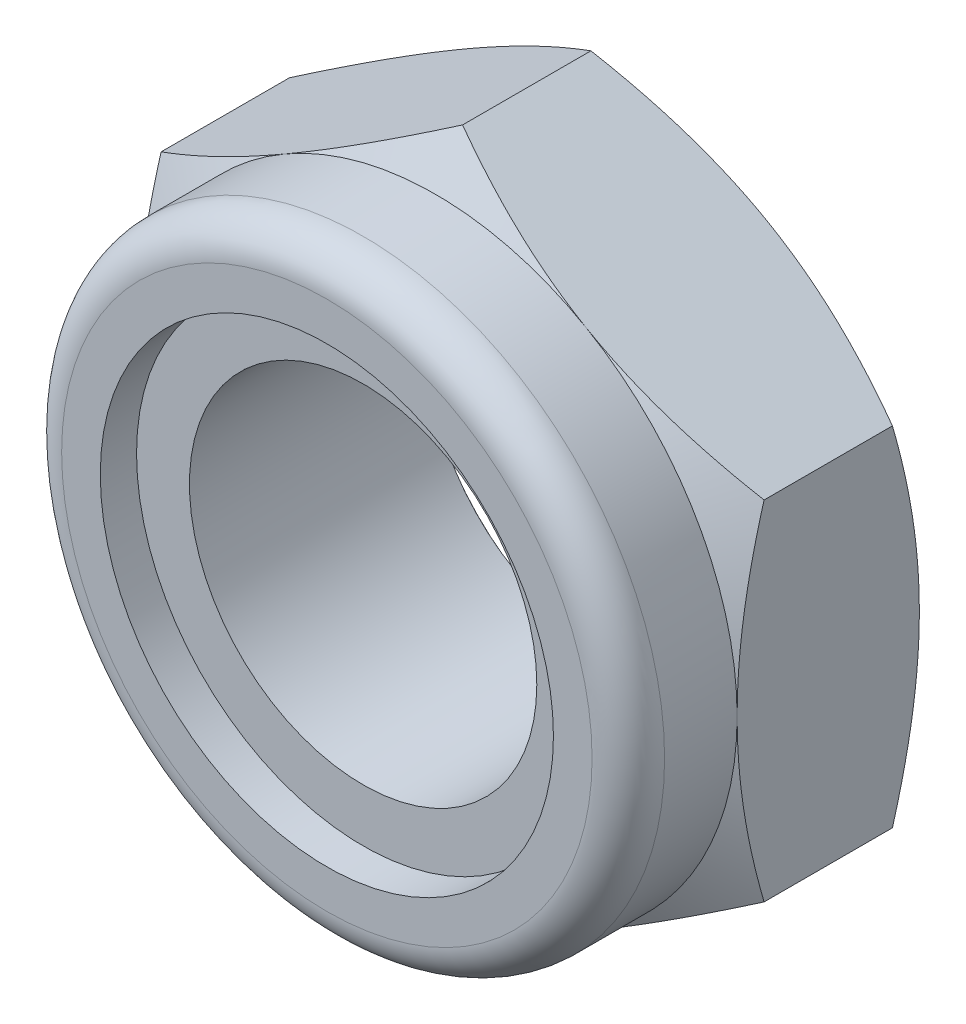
ISO-10303-21;
HEADER;
FILE_DESCRIPTION(('STEP AP214'),'2;1');
FILE_NAME('part.step','',(''),(''),'','','');
FILE_SCHEMA(('AUTOMOTIVE_DESIGN { 1 0 10303 214 1 1 1 1 }'));
ENDSEC;
DATA;
#1=APPLICATION_CONTEXT('core data for automotive mechanical design processes');
#2=APPLICATION_PROTOCOL_DEFINITION('international standard','automotive_design',2000,#1);
#3=PRODUCT_CONTEXT('',#1,'mechanical');
#4=PRODUCT('Part','Part','',(#3));
#5=PRODUCT_RELATED_PRODUCT_CATEGORY('part','',(#4));
#6=PRODUCT_DEFINITION_FORMATION('','',#4);
#7=PRODUCT_DEFINITION_CONTEXT('part definition',#1,'design');
#8=PRODUCT_DEFINITION('design','',#6,#7);
#9=PRODUCT_DEFINITION_SHAPE('','',#8);
#10=(LENGTH_UNIT() NAMED_UNIT(*) SI_UNIT(.MILLI.,.METRE.));
#11=(NAMED_UNIT(*) PLANE_ANGLE_UNIT() SI_UNIT($,.RADIAN.));
#12=(NAMED_UNIT(*) SI_UNIT($,.STERADIAN.) SOLID_ANGLE_UNIT());
#13=UNCERTAINTY_MEASURE_WITH_UNIT(LENGTH_MEASURE(1.E-05),#10,'distance_accuracy_value','');
#14=(GEOMETRIC_REPRESENTATION_CONTEXT(3) GLOBAL_UNCERTAINTY_ASSIGNED_CONTEXT((#13)) GLOBAL_UNIT_ASSIGNED_CONTEXT((#10,
#11,#12)) REPRESENTATION_CONTEXT('',''));
#15=CARTESIAN_POINT('',(0.,0.,0.));
#16=DIRECTION('',(0.,0.,1.));
#17=DIRECTION('',(1.,0.,0.));
#18=AXIS2_PLACEMENT_3D('',#15,#16,#17);
#19=CARTESIAN_POINT('',(0.,0.,-13.9));
#20=DIRECTION('',(0.,0.,1.));
#21=DIRECTION('',(1.,0.,0.));
#22=AXIS2_PLACEMENT_3D('',#19,#20,#21);
#23=CYLINDRICAL_SURFACE('',#22,13.25);
#24=CARTESIAN_POINT('',(0.,0.,5.53333333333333));
#25=DIRECTION('',(0.,0.,1.));
#26=DIRECTION('',(1.,0.,0.));
#27=AXIS2_PLACEMENT_3D('',#24,#25,#26);
#28=CIRCLE('',#27,13.25);
#29=CARTESIAN_POINT('',(13.25,0.,5.53333333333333));
#30=VERTEX_POINT('',#29);
#31=EDGE_CURVE('E277',#30,#30,#28,.T.);
#32=ORIENTED_EDGE('',*,*,#31,.T.);
#33=EDGE_LOOP('',(#32));
#34=FACE_BOUND('',#33,.T.);
#35=CARTESIAN_POINT('',(0.,0.,-12.649236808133));
#36=DIRECTION('',(0.,0.,-1.));
#37=DIRECTION('',(-1.,0.,0.));
#38=AXIS2_PLACEMENT_3D('',#35,#36,#37);
#39=CIRCLE('',#38,13.25);
#40=CARTESIAN_POINT('',(-13.25,0.,-12.649236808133));
#41=VERTEX_POINT('',#40);
#42=EDGE_CURVE('E39',#41,#41,#39,.F.);
#43=ORIENTED_EDGE('',*,*,#42,.F.);
#44=EDGE_LOOP('',(#43));
#45=FACE_BOUND('',#44,.T.);
#46=ADVANCED_FACE('F34',(#34,#45),#23,.F.);
#47=CARTESIAN_POINT('',(-45.9999999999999,0.,-13.9));
#48=DIRECTION('',(0.,0.,1.));
#49=DIRECTION('',(1.,0.,0.));
#50=AXIS2_PLACEMENT_3D('',#47,#48,#49);
#51=PLANE('',#50);
#52=CARTESIAN_POINT('',(0.,0.,-13.9));
#53=DIRECTION('',(0.,0.,1.));
#54=DIRECTION('',(1.,0.,0.));
#55=AXIS2_PLACEMENT_3D('',#52,#53,#54);
#56=CIRCLE('',#55,23.);
#57=CARTESIAN_POINT('',(23.,0.,-13.9));
#58=VERTEX_POINT('',#57);
#59=CARTESIAN_POINT('',(11.5,19.9185842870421,-13.9));
#60=VERTEX_POINT('',#59);
#61=EDGE_CURVE('E213',#58,#60,#56,.T.);
#62=ORIENTED_EDGE('',*,*,#61,.F.);
#63=CARTESIAN_POINT('',(0.,0.,-13.9));
#64=DIRECTION('',(0.,0.,1.));
#65=DIRECTION('',(1.,0.,0.));
#66=AXIS2_PLACEMENT_3D('',#63,#64,#65);
#67=CIRCLE('',#66,23.);
#68=CARTESIAN_POINT('',(11.5,-19.9185842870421,-13.9));
#69=VERTEX_POINT('',#68);
#70=EDGE_CURVE('E253',#58,#69,#67,.F.);
#71=ORIENTED_EDGE('',*,*,#70,.T.);
#72=CARTESIAN_POINT('',(-11.5,-19.9185842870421,-13.9));
#73=VERTEX_POINT('',#72);
#74=EDGE_CURVE('E255',#69,#73,#67,.F.);
#75=ORIENTED_EDGE('',*,*,#74,.T.);
#76=CARTESIAN_POINT('',(-23.,0.,-13.9));
#77=VERTEX_POINT('',#76);
#78=EDGE_CURVE('E574',#73,#77,#67,.F.);
#79=ORIENTED_EDGE('',*,*,#78,.T.);
#80=CARTESIAN_POINT('',(-11.5,19.9185842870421,-13.9));
#81=VERTEX_POINT('',#80);
#82=EDGE_CURVE('E575',#77,#81,#67,.F.);
#83=ORIENTED_EDGE('',*,*,#82,.T.);
#84=EDGE_CURVE('E237',#81,#60,#67,.F.);
#85=ORIENTED_EDGE('',*,*,#84,.T.);
#86=EDGE_LOOP('',(#62,#71,#75,#79,#83,#85));
#87=FACE_BOUND('',#86,.T.);
#88=CARTESIAN_POINT('',(0.,0.,-13.9));
#89=DIRECTION('',(0.,0.,1.));
#90=DIRECTION('',(1.,0.,0.));
#91=AXIS2_PLACEMENT_3D('',#88,#89,#90);
#92=CIRCLE('',#91,15.);
#93=CARTESIAN_POINT('',(15.,0.,-13.9));
#94=VERTEX_POINT('',#93);
#95=EDGE_CURVE('E158',#94,#94,#92,.F.);
#96=ORIENTED_EDGE('',*,*,#95,.F.);
#97=EDGE_LOOP('',(#96));
#98=FACE_BOUND('',#97,.T.);
#99=ADVANCED_FACE('F219',(#87,#98),#51,.F.);
#100=CARTESIAN_POINT('',(0.,26.5581123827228,-13.9));
#101=DIRECTION('',(-0.500000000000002,0.866025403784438,0.));
#102=DIRECTION('',(-0.866025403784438,-0.500000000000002,0.));
#103=AXIS2_PLACEMENT_3D('',#100,#101,#102);
#104=PLANE('',#103);
#105=DIRECTION('',(0.,0.,1.));
#106=VECTOR('',#105,1.);
#107=CARTESIAN_POINT('',(-23.,13.2790561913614,-13.9));
#108=LINE('',#107,#106);
#109=CARTESIAN_POINT('',(-23.,13.2790561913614,-11.845722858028));
#110=VERTEX_POINT('',#109);
#111=CARTESIAN_POINT('',(-23.,13.2790561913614,-2.05427714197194));
#112=VERTEX_POINT('',#111);
#113=EDGE_CURVE('E249',#110,#112,#108,.T.);
#114=ORIENTED_EDGE('',*,*,#113,.T.);
#115=CARTESIAN_POINT('',(-23.0002,13.2789407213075,-2.05434380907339));
#116=CARTESIAN_POINT('',(-22.4946699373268,13.5708086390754,-1.88584599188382));
#117=CARTESIAN_POINT('',(-21.9871680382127,13.8638149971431,-1.72499439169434));
#118=CARTESIAN_POINT('',(-20.9680946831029,14.4521772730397,-1.42070899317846));
#119=CARTESIAN_POINT('',(-20.4565219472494,14.7475339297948,-1.27728092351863));
#120=CARTESIAN_POINT('',(-19.4283073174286,15.3411739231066,-1.00976772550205));
#121=CARTESIAN_POINT('',(-18.9116563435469,15.6394625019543,-0.885728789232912));
#122=CARTESIAN_POINT('',(-17.874786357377,16.2380996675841,-0.659665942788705));
#123=CARTESIAN_POINT('',(-17.3545677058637,16.5384480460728,-0.557639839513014));
#124=CARTESIAN_POINT('',(-16.3238595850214,17.133527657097,-0.379933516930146));
#125=CARTESIAN_POINT('',(-15.8134465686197,17.4282147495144,-0.303665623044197));
#126=CARTESIAN_POINT('',(-14.7902817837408,18.0189392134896,-0.175781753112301));
#127=CARTESIAN_POINT('',(-14.2775299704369,18.3149766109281,-0.124166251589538));
#128=CARTESIAN_POINT('',(-13.2511650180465,18.9075486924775,-0.046890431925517));
#129=CARTESIAN_POINT('',(-12.737553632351,19.2040823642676,-0.0211992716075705));
#130=CARTESIAN_POINT('',(-11.709856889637,19.7974233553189,0.00367538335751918));
#131=CARTESIAN_POINT('',(-11.1957715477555,20.0942306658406,0.00285969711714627));
#132=CARTESIAN_POINT('',(-10.2346805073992,20.649116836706,-0.0234279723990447));
#133=CARTESIAN_POINT('',(-9.78760635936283,20.9072352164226,-0.0456944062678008));
#134=CARTESIAN_POINT('',(-8.89452539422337,21.422855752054,-0.109851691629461));
#135=CARTESIAN_POINT('',(-8.44851856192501,21.6803579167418,-0.151742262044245));
#136=CARTESIAN_POINT('',(-7.5577370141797,22.1946508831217,-0.254421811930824));
#137=CARTESIAN_POINT('',(-7.1129637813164,22.4514408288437,-0.315227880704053));
#138=CARTESIAN_POINT('',(-6.22554696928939,22.9637911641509,-0.454662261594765));
#139=CARTESIAN_POINT('',(-5.78290338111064,23.219351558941,-0.533290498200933));
#140=CARTESIAN_POINT('',(-4.43913170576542,23.9951784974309,-0.797926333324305));
#141=CARTESIAN_POINT('',(-3.54182151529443,24.513240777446,-1.01033549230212));
#142=CARTESIAN_POINT('',(-2.20576568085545,25.2846129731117,-1.37195212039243));
#143=CARTESIAN_POINT('',(-1.76244815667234,25.5405624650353,-1.49952801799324));
#144=CARTESIAN_POINT('',(-0.878879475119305,26.0506910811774,-1.76759530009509));
#145=CARTESIAN_POINT('',(-0.438627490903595,26.3048706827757,-1.90808304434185));
#146=CARTESIAN_POINT('',(0.000199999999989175,26.5582278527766,-2.05434380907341));
#147=B_SPLINE_CURVE_WITH_KNOTS('',3,(#115,#116,#117,#118,#119,#120,#121,#122,#123,#124,#125,
#126,#127,#128,#129,#130,#131,#132,#133,#134,#135,#136,#137,#138,#139,#140,#141,#142,#143,#144,
#145,#146),.UNSPECIFIED.,.F.,.F.,(4,2,2,2,2,2,2,2,2,2,2,2,2,2,2,4),(0.,1.82275209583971,
3.64610187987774,5.47373144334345,7.30117883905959,9.08355891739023,10.8659733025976,
12.6462646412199,14.4265009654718,15.9762768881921,17.5260306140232,19.0771885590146,
20.6283399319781,23.7989683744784,25.381520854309,26.9636285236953),.UNSPECIFIED.);
#148=CARTESIAN_POINT('',(-11.5,19.9185842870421,0.));
#149=VERTEX_POINT('',#148);
#150=EDGE_CURVE('E61',#112,#149,#147,.T.);
#151=ORIENTED_EDGE('',*,*,#150,.T.);
#152=CARTESIAN_POINT('',(0.,26.5581123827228,-2.05427714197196));
#153=VERTEX_POINT('',#152);
#154=EDGE_CURVE('E140',#149,#153,#147,.T.);
#155=ORIENTED_EDGE('',*,*,#154,.T.);
#156=DIRECTION('',(0.,0.,1.));
#157=VECTOR('',#156,1.);
#158=CARTESIAN_POINT('',(0.,26.5581123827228,-13.9));
#159=LINE('',#158,#157);
#160=CARTESIAN_POINT('',(0.,26.5581123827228,-11.845722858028));
#161=VERTEX_POINT('',#160);
#162=EDGE_CURVE('E137',#161,#153,#159,.T.);
#163=ORIENTED_EDGE('',*,*,#162,.F.);
#164=CARTESIAN_POINT('',(-23.0002,13.2789407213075,-11.8456561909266));
#165=CARTESIAN_POINT('',(-22.4946699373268,13.5708086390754,-12.0141540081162));
#166=CARTESIAN_POINT('',(-21.9871680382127,13.8638149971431,-12.1750056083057));
#167=CARTESIAN_POINT('',(-20.9680946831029,14.4521772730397,-12.4792910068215));
#168=CARTESIAN_POINT('',(-20.4565219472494,14.7475339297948,-12.6227190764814));
#169=CARTESIAN_POINT('',(-19.4283073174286,15.3411739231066,-12.890232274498));
#170=CARTESIAN_POINT('',(-18.9116563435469,15.6394625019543,-13.0142712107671));
#171=CARTESIAN_POINT('',(-17.874786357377,16.2380996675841,-13.2403340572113));
#172=CARTESIAN_POINT('',(-17.3545677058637,16.5384480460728,-13.342360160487));
#173=CARTESIAN_POINT('',(-16.3238595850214,17.133527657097,-13.5200664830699));
#174=CARTESIAN_POINT('',(-15.8134465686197,17.4282147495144,-13.5963343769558));
#175=CARTESIAN_POINT('',(-14.7902817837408,18.0189392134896,-13.7242182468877));
#176=CARTESIAN_POINT('',(-14.2775299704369,18.3149766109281,-13.7758337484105));
#177=CARTESIAN_POINT('',(-13.2511650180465,18.9075486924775,-13.8531095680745));
#178=CARTESIAN_POINT('',(-12.737553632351,19.2040823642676,-13.8788007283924));
#179=CARTESIAN_POINT('',(-11.709856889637,19.7974233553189,-13.9036753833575));
#180=CARTESIAN_POINT('',(-11.1957715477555,20.0942306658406,-13.9028596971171));
#181=CARTESIAN_POINT('',(-10.2346805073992,20.649116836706,-13.876572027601));
#182=CARTESIAN_POINT('',(-9.78760635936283,20.9072352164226,-13.8543055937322));
#183=CARTESIAN_POINT('',(-8.89452539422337,21.422855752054,-13.7901483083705));
#184=CARTESIAN_POINT('',(-8.44851856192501,21.6803579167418,-13.7482577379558));
#185=CARTESIAN_POINT('',(-7.5577370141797,22.1946508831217,-13.6455781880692));
#186=CARTESIAN_POINT('',(-7.1129637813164,22.4514408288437,-13.5847721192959));
#187=CARTESIAN_POINT('',(-6.22554696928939,22.9637911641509,-13.4453377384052));
#188=CARTESIAN_POINT('',(-5.78290338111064,23.219351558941,-13.3667095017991));
#189=CARTESIAN_POINT('',(-4.43913170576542,23.9951784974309,-13.1020736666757));
#190=CARTESIAN_POINT('',(-3.54182151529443,24.513240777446,-12.8896645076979));
#191=CARTESIAN_POINT('',(-2.20576568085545,25.2846129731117,-12.5280478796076));
#192=CARTESIAN_POINT('',(-1.76244815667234,25.5405624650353,-12.4004719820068));
#193=CARTESIAN_POINT('',(-0.878879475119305,26.0506910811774,-12.1324046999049));
#194=CARTESIAN_POINT('',(-0.438627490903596,26.3048706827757,-11.9919169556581));
#195=CARTESIAN_POINT('',(0.000199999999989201,26.5582278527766,-11.8456561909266));
#196=B_SPLINE_CURVE_WITH_KNOTS('',3,(#164,#165,#166,#167,#168,#169,#170,#171,#172,#173,#174,
#175,#176,#177,#178,#179,#180,#181,#182,#183,#184,#185,#186,#187,#188,#189,#190,#191,#192,#193,
#194,#195),.UNSPECIFIED.,.F.,.F.,(4,2,2,2,2,2,2,2,2,2,2,2,2,2,2,4),(0.,1.82275209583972,
3.64610187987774,5.47373144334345,7.30117883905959,9.08355891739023,10.8659733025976,
12.6462646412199,14.4265009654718,15.9762768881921,17.5260306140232,19.0771885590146,
20.6283399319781,23.7989683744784,25.381520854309,26.9636285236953),.UNSPECIFIED.);
#197=EDGE_CURVE('E252',#81,#161,#196,.T.);
#198=ORIENTED_EDGE('',*,*,#197,.F.);
#199=EDGE_CURVE('E231',#110,#81,#196,.T.);
#200=ORIENTED_EDGE('',*,*,#199,.F.);
#201=EDGE_LOOP('',(#114,#151,#155,#163,#198,#200));
#202=FACE_BOUND('',#201,.T.);
#203=ADVANCED_FACE('F36',(#202),#104,.T.);
#204=CARTESIAN_POINT('',(23.,13.2790561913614,-13.9));
#205=DIRECTION('',(0.500000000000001,0.866025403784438,0.));
#206=DIRECTION('',(-0.866025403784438,0.500000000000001,0.));
#207=AXIS2_PLACEMENT_3D('',#204,#205,#206);
#208=PLANE('',#207);
#209=ORIENTED_EDGE('',*,*,#162,.T.);
#210=CARTESIAN_POINT('',(-0.000200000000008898,26.5582278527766,-2.05434380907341));
#211=CARTESIAN_POINT('',(0.505330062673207,26.2663599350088,-1.88584599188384));
#212=CARTESIAN_POINT('',(1.0128319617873,25.973353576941,-1.72499439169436));
#213=CARTESIAN_POINT('',(2.03190531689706,25.3849913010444,-1.42070899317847));
#214=CARTESIAN_POINT('',(2.54347805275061,25.0896346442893,-1.27728092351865));
#215=CARTESIAN_POINT('',(3.57169268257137,24.4959946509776,-1.00976772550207));
#216=CARTESIAN_POINT('',(4.08834365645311,24.1977060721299,-0.885728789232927));
#217=CARTESIAN_POINT('',(5.12521364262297,23.5990689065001,-0.659665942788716));
#218=CARTESIAN_POINT('',(5.64543229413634,23.2987205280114,-0.557639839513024));
#219=CARTESIAN_POINT('',(6.6761404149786,22.7036409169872,-0.379933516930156));
#220=CARTESIAN_POINT('',(7.18655343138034,22.4089538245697,-0.303665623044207));
#221=CARTESIAN_POINT('',(8.20971821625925,21.8182293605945,-0.17578175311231));
#222=CARTESIAN_POINT('',(8.72247002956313,21.5221919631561,-0.124166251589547));
#223=CARTESIAN_POINT('',(9.74883498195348,20.9296198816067,-0.0468904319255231));
#224=CARTESIAN_POINT('',(10.262446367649,20.6330862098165,-0.0211992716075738));
#225=CARTESIAN_POINT('',(11.290143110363,20.0397452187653,0.00367538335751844));
#226=CARTESIAN_POINT('',(11.8042284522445,19.7429379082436,0.00285969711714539));
#227=CARTESIAN_POINT('',(12.7653194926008,19.1880517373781,-0.0234279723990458));
#228=CARTESIAN_POINT('',(13.2123936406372,18.9299333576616,-0.0456944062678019));
#229=CARTESIAN_POINT('',(14.1054746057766,18.4143128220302,-0.109851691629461));
#230=CARTESIAN_POINT('',(14.551481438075,18.1568106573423,-0.151742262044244));
#231=CARTESIAN_POINT('',(15.4422629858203,17.6425176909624,-0.25442181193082));
#232=CARTESIAN_POINT('',(15.8870362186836,17.3857277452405,-0.315227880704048));
#233=CARTESIAN_POINT('',(16.7744530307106,16.8733774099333,-0.454662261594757));
#234=CARTESIAN_POINT('',(17.2170966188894,16.6178170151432,-0.533290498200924));
#235=CARTESIAN_POINT('',(18.5608682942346,15.8419900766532,-0.797926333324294));
#236=CARTESIAN_POINT('',(19.4581784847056,15.3239277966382,-1.01033549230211));
#237=CARTESIAN_POINT('',(20.7942343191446,14.5525556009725,-1.37195212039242));
#238=CARTESIAN_POINT('',(21.2375518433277,14.2966061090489,-1.49952801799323));
#239=CARTESIAN_POINT('',(22.1211205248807,13.7864774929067,-1.76759530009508));
#240=CARTESIAN_POINT('',(22.5613725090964,13.5322978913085,-1.90808304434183));
#241=CARTESIAN_POINT('',(23.0002,13.2789407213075,-2.05434380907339));
#242=B_SPLINE_CURVE_WITH_KNOTS('',3,(#210,#211,#212,#213,#214,#215,#216,#217,#218,#219,#220,
#221,#222,#223,#224,#225,#226,#227,#228,#229,#230,#231,#232,#233,#234,#235,#236,#237,#238,#239,
#240,#241),.UNSPECIFIED.,.F.,.F.,(4,2,2,2,2,2,2,2,2,2,2,2,2,2,2,4),(0.,1.82275209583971,
3.64610187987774,5.47373144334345,7.3011788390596,9.08355891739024,10.8659733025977,
12.6462646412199,14.4265009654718,15.9762768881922,17.5260306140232,19.0771885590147,
20.6283399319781,23.7989683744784,25.381520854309,26.9636285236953),.UNSPECIFIED.);
#243=CARTESIAN_POINT('',(11.5,19.9185842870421,0.));
#244=VERTEX_POINT('',#243);
#245=EDGE_CURVE('E129',#153,#244,#242,.T.);
#246=ORIENTED_EDGE('',*,*,#245,.T.);
#247=CARTESIAN_POINT('',(23.,13.2790561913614,-2.05427714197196));
#248=VERTEX_POINT('',#247);
#249=EDGE_CURVE('E133',#244,#248,#242,.T.);
#250=ORIENTED_EDGE('',*,*,#249,.T.);
#251=DIRECTION('',(0.,0.,1.));
#252=VECTOR('',#251,1.);
#253=CARTESIAN_POINT('',(23.,13.2790561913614,-13.9));
#254=LINE('',#253,#252);
#255=CARTESIAN_POINT('',(23.,13.2790561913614,-11.845722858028));
#256=VERTEX_POINT('',#255);
#257=EDGE_CURVE('E238',#256,#248,#254,.T.);
#258=ORIENTED_EDGE('',*,*,#257,.F.);
#259=CARTESIAN_POINT('',(-0.000200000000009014,26.5582278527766,-11.8456561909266));
#260=CARTESIAN_POINT('',(0.505330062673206,26.2663599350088,-12.0141540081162));
#261=CARTESIAN_POINT('',(1.0128319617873,25.973353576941,-12.1750056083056));
#262=CARTESIAN_POINT('',(2.03190531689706,25.3849913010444,-12.4792910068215));
#263=CARTESIAN_POINT('',(2.54347805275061,25.0896346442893,-12.6227190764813));
#264=CARTESIAN_POINT('',(3.57169268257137,24.4959946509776,-12.8902322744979));
#265=CARTESIAN_POINT('',(4.08834365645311,24.1977060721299,-13.0142712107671));
#266=CARTESIAN_POINT('',(5.12521364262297,23.5990689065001,-13.2403340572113));
#267=CARTESIAN_POINT('',(5.64543229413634,23.2987205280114,-13.342360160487));
#268=CARTESIAN_POINT('',(6.6761404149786,22.7036409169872,-13.5200664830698));
#269=CARTESIAN_POINT('',(7.18655343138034,22.4089538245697,-13.5963343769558));
#270=CARTESIAN_POINT('',(8.20971821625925,21.8182293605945,-13.7242182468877));
#271=CARTESIAN_POINT('',(8.72247002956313,21.5221919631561,-13.7758337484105));
#272=CARTESIAN_POINT('',(9.74883498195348,20.9296198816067,-13.8531095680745));
#273=CARTESIAN_POINT('',(10.262446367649,20.6330862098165,-13.8788007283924));
#274=CARTESIAN_POINT('',(11.290143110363,20.0397452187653,-13.9036753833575));
#275=CARTESIAN_POINT('',(11.8042284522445,19.7429379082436,-13.9028596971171));
#276=CARTESIAN_POINT('',(12.7653194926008,19.1880517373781,-13.876572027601));
#277=CARTESIAN_POINT('',(13.2123936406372,18.9299333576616,-13.8543055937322));
#278=CARTESIAN_POINT('',(14.1054746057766,18.4143128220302,-13.7901483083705));
#279=CARTESIAN_POINT('',(14.551481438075,18.1568106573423,-13.7482577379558));
#280=CARTESIAN_POINT('',(15.4422629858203,17.6425176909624,-13.6455781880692));
#281=CARTESIAN_POINT('',(15.8870362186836,17.3857277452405,-13.584772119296));
#282=CARTESIAN_POINT('',(16.7744530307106,16.8733774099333,-13.4453377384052));
#283=CARTESIAN_POINT('',(17.2170966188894,16.6178170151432,-13.3667095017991));
#284=CARTESIAN_POINT('',(18.5608682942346,15.8419900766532,-13.1020736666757));
#285=CARTESIAN_POINT('',(19.4581784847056,15.3239277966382,-12.8896645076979));
#286=CARTESIAN_POINT('',(20.7942343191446,14.5525556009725,-12.5280478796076));
#287=CARTESIAN_POINT('',(21.2375518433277,14.2966061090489,-12.4004719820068));
#288=CARTESIAN_POINT('',(22.1211205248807,13.7864774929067,-12.1324046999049));
#289=CARTESIAN_POINT('',(22.5613725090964,13.5322978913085,-11.9919169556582));
#290=CARTESIAN_POINT('',(23.0002,13.2789407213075,-11.8456561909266));
#291=B_SPLINE_CURVE_WITH_KNOTS('',3,(#259,#260,#261,#262,#263,#264,#265,#266,#267,#268,#269,
#270,#271,#272,#273,#274,#275,#276,#277,#278,#279,#280,#281,#282,#283,#284,#285,#286,#287,#288,
#289,#290),.UNSPECIFIED.,.F.,.F.,(4,2,2,2,2,2,2,2,2,2,2,2,2,2,2,4),(0.,1.82275209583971,
3.64610187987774,5.47373144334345,7.3011788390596,9.08355891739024,10.8659733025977,
12.6462646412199,14.4265009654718,15.9762768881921,17.5260306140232,19.0771885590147,
20.6283399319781,23.7989683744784,25.381520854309,26.9636285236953),.UNSPECIFIED.);
#292=EDGE_CURVE('E223',#60,#256,#291,.T.);
#293=ORIENTED_EDGE('',*,*,#292,.F.);
#294=EDGE_CURVE('E229',#161,#60,#291,.T.);
#295=ORIENTED_EDGE('',*,*,#294,.F.);
#296=EDGE_LOOP('',(#209,#246,#250,#258,#293,#295));
#297=FACE_BOUND('',#296,.T.);
#298=ADVANCED_FACE('F131',(#297),#208,.T.);
#299=CARTESIAN_POINT('',(23.,13.2790561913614,-13.9));
#300=DIRECTION('',(-1.,0.,0.));
#301=DIRECTION('',(0.,0.,1.));
#302=AXIS2_PLACEMENT_3D('',#299,#300,#301);
#303=PLANE('',#302);
#304=CARTESIAN_POINT('',(23.,-35.2180139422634,-11.0061142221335));
#305=CARTESIAN_POINT('',(23.,-34.7131179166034,-10.7620572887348));
#306=CARTESIAN_POINT('',(23.,-34.2076112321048,-10.5192598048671));
#307=CARTESIAN_POINT('',(23.,-33.1952483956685,-10.0364809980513));
#308=CARTESIAN_POINT('',(23.,-32.6883922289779,-9.7964997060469));
#309=CARTESIAN_POINT('',(23.,-31.6731272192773,-9.3196154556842));
#310=CARTESIAN_POINT('',(23.,-31.1647181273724,-9.08271302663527));
#311=CARTESIAN_POINT('',(23.,-30.1462960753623,-8.61238713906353));
#312=CARTESIAN_POINT('',(23.,-29.6362831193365,-8.37896367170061));
#313=CARTESIAN_POINT('',(23.,-28.0977616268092,-7.68184178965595));
#314=CARTESIAN_POINT('',(23.,-27.0665726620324,-7.22402785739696));
#315=CARTESIAN_POINT('',(23.,-24.9957268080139,-6.32805391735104));
#316=CARTESIAN_POINT('',(23.,-23.9560703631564,-5.8898928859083));
#317=CARTESIAN_POINT('',(23.,-21.8537217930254,-5.03326545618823));
#318=CARTESIAN_POINT('',(23.,-20.7909035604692,-4.61510688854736));
#319=CARTESIAN_POINT('',(23.,-18.6527242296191,-3.81153823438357));
#320=CARTESIAN_POINT('',(23.,-17.577361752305,-3.42613178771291));
#321=CARTESIAN_POINT('',(23.,-15.4146266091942,-2.69842857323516));
#322=CARTESIAN_POINT('',(23.,-14.327285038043,-2.35604014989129));
#323=CARTESIAN_POINT('',(23.,-12.1370388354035,-1.72547560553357));
#324=CARTESIAN_POINT('',(23.,-11.0341392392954,-1.4372823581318));
#325=CARTESIAN_POINT('',(23.,-9.36791170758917,-1.05618881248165));
#326=CARTESIAN_POINT('',(23.,-8.81040454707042,-0.937670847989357));
#327=CARTESIAN_POINT('',(23.,-7.69167970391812,-0.719571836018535));
#328=CARTESIAN_POINT('',(23.,-7.13046210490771,-0.61999036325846));
#329=CARTESIAN_POINT('',(23.,-6.0046930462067,-0.441529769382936));
#330=CARTESIAN_POINT('',(23.,-5.4401413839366,-0.362651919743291));
#331=CARTESIAN_POINT('',(23.,-4.30835108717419,-0.227182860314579));
#332=CARTESIAN_POINT('',(23.,-3.74111244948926,-0.170591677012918));
#333=CARTESIAN_POINT('',(23.,-2.60837639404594,-0.081219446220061));
#334=CARTESIAN_POINT('',(23.,-2.04289080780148,-0.0482894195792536));
#335=CARTESIAN_POINT('',(23.,-0.911034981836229,-0.00641263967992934));
#336=CARTESIAN_POINT('',(23.,-0.34466475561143,0.00253447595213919));
#337=CARTESIAN_POINT('',(23.,0.787786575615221,-0.00376669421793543));
#338=CARTESIAN_POINT('',(23.,1.35386771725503,-0.0190082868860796));
#339=CARTESIAN_POINT('',(23.,2.48489076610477,-0.0733081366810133));
#340=CARTESIAN_POINT('',(23.,3.0498326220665,-0.112367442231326));
#341=CARTESIAN_POINT('',(23.,4.41865655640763,-0.235046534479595));
#342=CARTESIAN_POINT('',(23.,5.22148876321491,-0.330575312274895));
#343=CARTESIAN_POINT('',(23.,6.82090570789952,-0.564419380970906));
#344=CARTESIAN_POINT('',(23.,7.6174895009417,-0.702741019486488));
#345=CARTESIAN_POINT('',(23.,9.20481563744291,-1.01746542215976));
#346=CARTESIAN_POINT('',(23.,9.99554164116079,-1.19394981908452));
#347=CARTESIAN_POINT('',(23.,11.568898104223,-1.57951953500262));
#348=CARTESIAN_POINT('',(23.,12.3515288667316,-1.78860362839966));
#349=CARTESIAN_POINT('',(23.,13.9271257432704,-2.23959590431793));
#350=CARTESIAN_POINT('',(23.,14.7199029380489,-2.48215963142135));
#351=CARTESIAN_POINT('',(23.,16.2976906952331,-2.99143683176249));
#352=CARTESIAN_POINT('',(23.,17.0827005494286,-3.25815248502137));
#353=CARTESIAN_POINT('',(23.,18.6411786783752,-3.81009153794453));
#354=CARTESIAN_POINT('',(23.,19.4146870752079,-4.09520208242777));
#355=CARTESIAN_POINT('',(23.,20.5700723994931,-4.53521033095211));
#356=CARTESIAN_POINT('',(23.,20.9543266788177,-4.68391196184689));
#357=CARTESIAN_POINT('',(23.,21.7213392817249,-4.98509471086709));
#358=CARTESIAN_POINT('',(23.,22.104097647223,-5.13757572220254));
#359=CARTESIAN_POINT('',(23.,22.4861626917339,-5.29177678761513));
#360=B_SPLINE_CURVE_WITH_KNOTS('',3,(#304,#305,#306,#307,#308,#309,#310,#311,#312,#313,#314,
#315,#316,#317,#318,#319,#320,#321,#322,#323,#324,#325,#326,#327,#328,#329,#330,#331,#332,#333,
#334,#335,#336,#337,#338,#339,#340,#341,#342,#343,#344,#345,#346,#347,#348,#349,#350,#351,#352,
#353,#354,#355,#356,#357,#358,#359),.UNSPECIFIED.,.F.,.F.,(4,2,2,2,2,2,2,2,2,2,2,2,2,2,2,2,2,2,
2,2,2,2,2,2,2,2,2,4),(0.,1.68236622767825,3.36475092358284,5.0474211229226,6.73008704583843,
10.1146618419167,13.4990601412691,16.925008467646,20.3513370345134,23.7702368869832,
27.1880544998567,28.897681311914,30.6072697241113,32.3169631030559,34.0266585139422,
35.7254924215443,37.4243006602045,39.1226389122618,40.8210519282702,43.2451895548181,
45.669686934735,48.0994227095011,50.5290671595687,53.0157707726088,55.5026990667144,
57.9756025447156,59.2116575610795,60.4476776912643),.UNSPECIFIED.);
#361=CARTESIAN_POINT('',(23.,-13.2790561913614,-2.05427714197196));
#362=VERTEX_POINT('',#361);
#363=CARTESIAN_POINT('',(23.,0.,0.));
#364=VERTEX_POINT('',#363);
#365=EDGE_CURVE('E199',#362,#364,#360,.T.);
#366=ORIENTED_EDGE('',*,*,#365,.F.);
#367=DIRECTION('',(0.,0.,1.));
#368=VECTOR('',#367,1.);
#369=CARTESIAN_POINT('',(23.,-13.2790561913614,-13.9));
#370=LINE('',#369,#368);
#371=CARTESIAN_POINT('',(23.,-13.2790561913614,-11.845722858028));
#372=VERTEX_POINT('',#371);
#373=EDGE_CURVE('E240',#372,#362,#370,.T.);
#374=ORIENTED_EDGE('',*,*,#373,.F.);
#375=CARTESIAN_POINT('',(23.,-35.2180139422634,-2.8938857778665));
#376=CARTESIAN_POINT('',(23.,-34.7131179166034,-3.13794271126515));
#377=CARTESIAN_POINT('',(23.,-34.2076112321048,-3.38074019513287));
#378=CARTESIAN_POINT('',(23.,-33.1952483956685,-3.86351900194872));
#379=CARTESIAN_POINT('',(23.,-32.6883922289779,-4.1035002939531));
#380=CARTESIAN_POINT('',(23.,-31.6731272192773,-4.58038454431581));
#381=CARTESIAN_POINT('',(23.,-31.1647181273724,-4.81728697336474));
#382=CARTESIAN_POINT('',(23.,-30.1462960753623,-5.28761286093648));
#383=CARTESIAN_POINT('',(23.,-29.6362831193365,-5.52103632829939));
#384=CARTESIAN_POINT('',(23.,-28.0977616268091,-6.21815821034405));
#385=CARTESIAN_POINT('',(23.,-27.0665726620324,-6.67597214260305));
#386=CARTESIAN_POINT('',(23.,-24.9957268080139,-7.57194608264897));
#387=CARTESIAN_POINT('',(23.,-23.9560703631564,-8.01010711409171));
#388=CARTESIAN_POINT('',(23.,-21.8537217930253,-8.86673454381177));
#389=CARTESIAN_POINT('',(23.,-20.7909035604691,-9.28489311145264));
#390=CARTESIAN_POINT('',(23.,-18.6527242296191,-10.0884617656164));
#391=CARTESIAN_POINT('',(23.,-17.5773617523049,-10.4738682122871));
#392=CARTESIAN_POINT('',(23.,-15.4146266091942,-11.2015714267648));
#393=CARTESIAN_POINT('',(23.,-14.3272850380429,-11.5439598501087));
#394=CARTESIAN_POINT('',(23.,-12.1370388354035,-12.1745243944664));
#395=CARTESIAN_POINT('',(23.,-11.0341392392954,-12.4627176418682));
#396=CARTESIAN_POINT('',(23.,-9.36791170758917,-12.8438111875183));
#397=CARTESIAN_POINT('',(23.,-8.81040454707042,-12.9623291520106));
#398=CARTESIAN_POINT('',(23.,-7.69167970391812,-13.1804281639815));
#399=CARTESIAN_POINT('',(23.,-7.13046210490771,-13.2800096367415));
#400=CARTESIAN_POINT('',(23.,-6.0046930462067,-13.4584702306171));
#401=CARTESIAN_POINT('',(23.,-5.4401413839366,-13.5373480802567));
#402=CARTESIAN_POINT('',(23.,-4.30835108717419,-13.6728171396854));
#403=CARTESIAN_POINT('',(23.,-3.74111244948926,-13.7294083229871));
#404=CARTESIAN_POINT('',(23.,-2.60837639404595,-13.8187805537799));
#405=CARTESIAN_POINT('',(23.,-2.04289080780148,-13.8517105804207));
#406=CARTESIAN_POINT('',(23.,-0.911034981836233,-13.8935873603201));
#407=CARTESIAN_POINT('',(23.,-0.344664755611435,-13.9025344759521));
#408=CARTESIAN_POINT('',(23.,0.787786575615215,-13.8962333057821));
#409=CARTESIAN_POINT('',(23.,1.35386771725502,-13.8809917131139));
#410=CARTESIAN_POINT('',(23.,2.48489076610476,-13.826691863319));
#411=CARTESIAN_POINT('',(23.,3.0498326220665,-13.7876325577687));
#412=CARTESIAN_POINT('',(23.,4.41865655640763,-13.6649534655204));
#413=CARTESIAN_POINT('',(23.,5.22148876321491,-13.5694246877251));
#414=CARTESIAN_POINT('',(23.,6.82090570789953,-13.3355806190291));
#415=CARTESIAN_POINT('',(23.,7.6174895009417,-13.1972589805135));
#416=CARTESIAN_POINT('',(23.,9.20481563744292,-12.8825345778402));
#417=CARTESIAN_POINT('',(23.,9.99554164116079,-12.7060501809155));
#418=CARTESIAN_POINT('',(23.,11.568898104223,-12.3204804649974));
#419=CARTESIAN_POINT('',(23.,12.3515288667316,-12.1113963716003));
#420=CARTESIAN_POINT('',(23.,13.9271257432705,-11.6604040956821));
#421=CARTESIAN_POINT('',(23.,14.7199029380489,-11.4178403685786));
#422=CARTESIAN_POINT('',(23.,16.2976906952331,-10.9085631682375));
#423=CARTESIAN_POINT('',(23.,17.0827005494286,-10.6418475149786));
#424=CARTESIAN_POINT('',(23.,18.6411786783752,-10.0899084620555));
#425=CARTESIAN_POINT('',(23.,19.4146870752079,-9.80479791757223));
#426=CARTESIAN_POINT('',(23.,20.5700723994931,-9.36478966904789));
#427=CARTESIAN_POINT('',(23.,20.9543266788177,-9.21608803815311));
#428=CARTESIAN_POINT('',(23.,21.7213392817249,-8.91490528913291));
#429=CARTESIAN_POINT('',(23.,22.1040976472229,-8.76242427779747));
#430=CARTESIAN_POINT('',(23.,22.4861626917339,-8.60822321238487));
#431=B_SPLINE_CURVE_WITH_KNOTS('',3,(#375,#376,#377,#378,#379,#380,#381,#382,#383,#384,#385,
#386,#387,#388,#389,#390,#391,#392,#393,#394,#395,#396,#397,#398,#399,#400,#401,#402,#403,#404,
#405,#406,#407,#408,#409,#410,#411,#412,#413,#414,#415,#416,#417,#418,#419,#420,#421,#422,#423,
#424,#425,#426,#427,#428,#429,#430),.UNSPECIFIED.,.F.,.F.,(4,2,2,2,2,2,2,2,2,2,2,2,2,2,2,2,2,2,
2,2,2,2,2,2,2,2,2,4),(0.,1.68236622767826,3.36475092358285,5.04742112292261,6.73008704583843,
10.1146618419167,13.4990601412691,16.925008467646,20.3513370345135,23.7702368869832,
27.1880544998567,28.897681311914,30.6072697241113,32.3169631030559,34.0266585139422,
35.7254924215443,37.4243006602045,39.1226389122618,40.8210519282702,43.2451895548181,
45.669686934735,48.0994227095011,50.5290671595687,53.0157707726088,55.5026990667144,
57.9756025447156,59.2116575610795,60.4476776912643),.UNSPECIFIED.);
#432=EDGE_CURVE('E320',#372,#58,#431,.T.);
#433=ORIENTED_EDGE('',*,*,#432,.T.);
#434=EDGE_CURVE('E230',#58,#256,#431,.T.);
#435=ORIENTED_EDGE('',*,*,#434,.T.);
#436=ORIENTED_EDGE('',*,*,#257,.T.);
#437=EDGE_CURVE('E147',#364,#248,#360,.T.);
#438=ORIENTED_EDGE('',*,*,#437,.F.);
#439=EDGE_LOOP('',(#366,#374,#433,#435,#436,#438));
#440=FACE_BOUND('',#439,.T.);
#441=ADVANCED_FACE('F218',(#440),#303,.F.);
#442=CARTESIAN_POINT('',(0.,-26.5581123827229,-13.9));
#443=DIRECTION('',(0.500000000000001,-0.866025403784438,0.));
#444=DIRECTION('',(0.866025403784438,0.500000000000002,0.));
#445=AXIS2_PLACEMENT_3D('',#442,#443,#444);
#446=PLANE('',#445);
#447=ORIENTED_EDGE('',*,*,#373,.T.);
#448=CARTESIAN_POINT('',(23.0002,-13.2789407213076,-2.0543438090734));
#449=CARTESIAN_POINT('',(22.4946699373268,-13.5708086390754,-1.88584599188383));
#450=CARTESIAN_POINT('',(21.9871680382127,-13.8638149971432,-1.72499439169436));
#451=CARTESIAN_POINT('',(20.9680946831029,-14.4521772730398,-1.42070899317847));
#452=CARTESIAN_POINT('',(20.4565219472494,-14.7475339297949,-1.27728092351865));
#453=CARTESIAN_POINT('',(19.4283073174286,-15.3411739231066,-1.00976772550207));
#454=CARTESIAN_POINT('',(18.9116563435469,-15.6394625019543,-0.88572878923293));
#455=CARTESIAN_POINT('',(17.874786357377,-16.2380996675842,-0.659665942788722));
#456=CARTESIAN_POINT('',(17.3545677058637,-16.5384480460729,-0.557639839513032));
#457=CARTESIAN_POINT('',(16.3238595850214,-17.1335276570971,-0.379933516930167));
#458=CARTESIAN_POINT('',(15.8134465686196,-17.4282147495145,-0.30366562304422));
#459=CARTESIAN_POINT('',(14.7902817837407,-18.0189392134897,-0.175781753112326));
#460=CARTESIAN_POINT('',(14.2775299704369,-18.3149766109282,-0.124166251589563));
#461=CARTESIAN_POINT('',(13.2511650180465,-18.9075486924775,-0.0468904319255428));
#462=CARTESIAN_POINT('',(12.737553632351,-19.2040823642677,-0.0211992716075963));
#463=CARTESIAN_POINT('',(11.7098568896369,-19.797423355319,0.00367538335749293));
#464=CARTESIAN_POINT('',(11.1957715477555,-20.0942306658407,0.00285969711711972));
#465=CARTESIAN_POINT('',(10.2346805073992,-20.6491168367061,-0.0234279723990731));
#466=CARTESIAN_POINT('',(9.78760635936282,-20.9072352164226,-0.0456944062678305));
#467=CARTESIAN_POINT('',(8.89452539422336,-21.422855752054,-0.109851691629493));
#468=CARTESIAN_POINT('',(8.448518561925,-21.6803579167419,-0.151742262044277));
#469=CARTESIAN_POINT('',(7.55773701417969,-22.1946508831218,-0.254421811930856));
#470=CARTESIAN_POINT('',(7.11296378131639,-22.4514408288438,-0.315227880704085));
#471=CARTESIAN_POINT('',(6.22554696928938,-22.963791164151,-0.454662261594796));
#472=CARTESIAN_POINT('',(5.78290338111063,-23.219351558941,-0.533290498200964));
#473=CARTESIAN_POINT('',(4.43913170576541,-23.995178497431,-0.797926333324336));
#474=CARTESIAN_POINT('',(3.54182151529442,-24.513240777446,-1.01033549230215));
#475=CARTESIAN_POINT('',(2.20576568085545,-25.2846129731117,-1.37195212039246));
#476=CARTESIAN_POINT('',(1.76244815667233,-25.5405624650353,-1.49952801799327));
#477=CARTESIAN_POINT('',(0.878879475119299,-26.0506910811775,-1.76759530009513));
#478=CARTESIAN_POINT('',(0.438627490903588,-26.3048706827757,-1.90808304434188));
#479=CARTESIAN_POINT('',(-0.000199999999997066,-26.5582278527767,-2.05434380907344));
#480=B_SPLINE_CURVE_WITH_KNOTS('',3,(#448,#449,#450,#451,#452,#453,#454,#455,#456,#457,#458,
#459,#460,#461,#462,#463,#464,#465,#466,#467,#468,#469,#470,#471,#472,#473,#474,#475,#476,#477,
#478,#479),.UNSPECIFIED.,.F.,.F.,(4,2,2,2,2,2,2,2,2,2,2,2,2,2,2,4),(0.,1.82275209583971,
3.64610187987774,5.47373144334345,7.3011788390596,9.08355891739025,10.8659733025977,
12.6462646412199,14.4265009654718,15.9762768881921,17.5260306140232,19.0771885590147,
20.6283399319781,23.7989683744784,25.381520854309,26.9636285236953),.UNSPECIFIED.);
#481=CARTESIAN_POINT('',(11.5,-19.9185842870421,0.));
#482=VERTEX_POINT('',#481);
#483=EDGE_CURVE('E363',#362,#482,#480,.T.);
#484=ORIENTED_EDGE('',*,*,#483,.T.);
#485=CARTESIAN_POINT('',(-1.02348685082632E-13,-26.5581123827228,-2.05427714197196));
#486=VERTEX_POINT('',#485);
#487=EDGE_CURVE('E193',#482,#486,#480,.T.);
#488=ORIENTED_EDGE('',*,*,#487,.T.);
#489=DIRECTION('',(0.,0.,1.));
#490=VECTOR('',#489,1.);
#491=CARTESIAN_POINT('',(0.,-26.5581123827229,-13.9));
#492=LINE('',#491,#490);
#493=CARTESIAN_POINT('',(-1.02348685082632E-13,-26.5581123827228,-11.845722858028));
#494=VERTEX_POINT('',#493);
#495=EDGE_CURVE('E243',#494,#486,#492,.T.);
#496=ORIENTED_EDGE('',*,*,#495,.F.);
#497=CARTESIAN_POINT('',(23.0002,-13.2789407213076,-11.8456561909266));
#498=CARTESIAN_POINT('',(22.4946699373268,-13.5708086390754,-12.0141540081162));
#499=CARTESIAN_POINT('',(21.9871680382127,-13.8638149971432,-12.1750056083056));
#500=CARTESIAN_POINT('',(20.9680946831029,-14.4521772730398,-12.4792910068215));
#501=CARTESIAN_POINT('',(20.4565219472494,-14.7475339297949,-12.6227190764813));
#502=CARTESIAN_POINT('',(19.4283073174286,-15.3411739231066,-12.8902322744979));
#503=CARTESIAN_POINT('',(18.9116563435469,-15.6394625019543,-13.0142712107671));
#504=CARTESIAN_POINT('',(17.874786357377,-16.2380996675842,-13.2403340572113));
#505=CARTESIAN_POINT('',(17.3545677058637,-16.5384480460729,-13.342360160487));
#506=CARTESIAN_POINT('',(16.3238595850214,-17.1335276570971,-13.5200664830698));
#507=CARTESIAN_POINT('',(15.8134465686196,-17.4282147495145,-13.5963343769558));
#508=CARTESIAN_POINT('',(14.7902817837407,-18.0189392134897,-13.7242182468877));
#509=CARTESIAN_POINT('',(14.2775299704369,-18.3149766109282,-13.7758337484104));
#510=CARTESIAN_POINT('',(13.2511650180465,-18.9075486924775,-13.8531095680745));
#511=CARTESIAN_POINT('',(12.737553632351,-19.2040823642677,-13.8788007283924));
#512=CARTESIAN_POINT('',(11.7098568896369,-19.7974233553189,-13.9036753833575));
#513=CARTESIAN_POINT('',(11.1957715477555,-20.0942306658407,-13.9028596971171));
#514=CARTESIAN_POINT('',(10.2346805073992,-20.6491168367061,-13.8765720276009));
#515=CARTESIAN_POINT('',(9.78760635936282,-20.9072352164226,-13.8543055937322));
#516=CARTESIAN_POINT('',(8.89452539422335,-21.422855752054,-13.7901483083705));
#517=CARTESIAN_POINT('',(8.448518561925,-21.6803579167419,-13.7482577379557));
#518=CARTESIAN_POINT('',(7.55773701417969,-22.1946508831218,-13.6455781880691));
#519=CARTESIAN_POINT('',(7.11296378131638,-22.4514408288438,-13.5847721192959));
#520=CARTESIAN_POINT('',(6.22554696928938,-22.963791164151,-13.4453377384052));
#521=CARTESIAN_POINT('',(5.78290338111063,-23.219351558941,-13.366709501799));
#522=CARTESIAN_POINT('',(4.43913170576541,-23.995178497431,-13.1020736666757));
#523=CARTESIAN_POINT('',(3.54182151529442,-24.513240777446,-12.8896645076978));
#524=CARTESIAN_POINT('',(2.20576568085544,-25.2846129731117,-12.5280478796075));
#525=CARTESIAN_POINT('',(1.76244815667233,-25.5405624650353,-12.4004719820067));
#526=CARTESIAN_POINT('',(0.878879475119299,-26.0506910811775,-12.1324046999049));
#527=CARTESIAN_POINT('',(0.438627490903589,-26.3048706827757,-11.9919169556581));
#528=CARTESIAN_POINT('',(-0.000199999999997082,-26.5582278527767,-11.8456561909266));
#529=B_SPLINE_CURVE_WITH_KNOTS('',3,(#497,#498,#499,#500,#501,#502,#503,#504,#505,#506,#507,
#508,#509,#510,#511,#512,#513,#514,#515,#516,#517,#518,#519,#520,#521,#522,#523,#524,#525,#526,
#527,#528),.UNSPECIFIED.,.F.,.F.,(4,2,2,2,2,2,2,2,2,2,2,2,2,2,2,4),(0.,1.82275209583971,
3.64610187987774,5.47373144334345,7.3011788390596,9.08355891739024,10.8659733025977,
12.6462646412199,14.4265009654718,15.9762768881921,17.5260306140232,19.0771885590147,
20.6283399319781,23.7989683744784,25.381520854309,26.9636285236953),.UNSPECIFIED.);
#530=EDGE_CURVE('E325',#69,#494,#529,.T.);
#531=ORIENTED_EDGE('',*,*,#530,.F.);
#532=EDGE_CURVE('E324',#372,#69,#529,.T.);
#533=ORIENTED_EDGE('',*,*,#532,.F.);
#534=EDGE_LOOP('',(#447,#484,#488,#496,#531,#533));
#535=FACE_BOUND('',#534,.T.);
#536=ADVANCED_FACE('F339',(#535),#446,.T.);
#537=CARTESIAN_POINT('',(-23.,-13.2790561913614,-13.9));
#538=DIRECTION('',(-0.500000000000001,-0.866025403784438,0.));
#539=DIRECTION('',(0.866025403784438,-0.500000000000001,0.));
#540=AXIS2_PLACEMENT_3D('',#537,#538,#539);
#541=PLANE('',#540);
#542=ORIENTED_EDGE('',*,*,#495,.T.);
#543=CARTESIAN_POINT('',(0.000200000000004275,-26.5582278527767,-2.05434380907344));
#544=CARTESIAN_POINT('',(-0.505330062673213,-26.2663599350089,-1.88584599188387));
#545=CARTESIAN_POINT('',(-1.0128319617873,-25.9733535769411,-1.72499439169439));
#546=CARTESIAN_POINT('',(-2.03190531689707,-25.3849913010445,-1.4207089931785));
#547=CARTESIAN_POINT('',(-2.54347805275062,-25.0896346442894,-1.27728092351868));
#548=CARTESIAN_POINT('',(-3.57169268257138,-24.4959946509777,-1.0097677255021));
#549=CARTESIAN_POINT('',(-4.08834365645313,-24.1977060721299,-0.885728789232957));
#550=CARTESIAN_POINT('',(-5.12521364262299,-23.5990689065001,-0.659665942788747));
#551=CARTESIAN_POINT('',(-5.64543229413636,-23.2987205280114,-0.557639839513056));
#552=CARTESIAN_POINT('',(-6.67614041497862,-22.7036409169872,-0.379933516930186));
#553=CARTESIAN_POINT('',(-7.18655343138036,-22.4089538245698,-0.303665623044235));
#554=CARTESIAN_POINT('',(-8.20971821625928,-21.8182293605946,-0.175781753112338));
#555=CARTESIAN_POINT('',(-8.72247002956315,-21.5221919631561,-0.124166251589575));
#556=CARTESIAN_POINT('',(-9.74883498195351,-20.9296198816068,-0.046890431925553));
#557=CARTESIAN_POINT('',(-10.262446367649,-20.6330862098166,-0.0211992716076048));
#558=CARTESIAN_POINT('',(-11.2901431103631,-20.0397452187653,0.00367538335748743));
#559=CARTESIAN_POINT('',(-11.8042284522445,-19.7429379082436,0.00285969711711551));
#560=CARTESIAN_POINT('',(-12.7653194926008,-19.1880517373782,-0.023427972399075));
#561=CARTESIAN_POINT('',(-13.2123936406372,-18.9299333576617,-0.0456944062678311));
#562=CARTESIAN_POINT('',(-14.1054746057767,-18.4143128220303,-0.10985169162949));
#563=CARTESIAN_POINT('',(-14.551481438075,-18.1568106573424,-0.151742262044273));
#564=CARTESIAN_POINT('',(-15.4422629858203,-17.6425176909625,-0.254421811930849));
#565=CARTESIAN_POINT('',(-15.8870362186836,-17.3857277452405,-0.315227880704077));
#566=CARTESIAN_POINT('',(-16.7744530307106,-16.8733774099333,-0.454662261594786));
#567=CARTESIAN_POINT('',(-17.2170966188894,-16.6178170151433,-0.533290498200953));
#568=CARTESIAN_POINT('',(-18.5608682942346,-15.8419900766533,-0.797926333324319));
#569=CARTESIAN_POINT('',(-19.4581784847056,-15.3239277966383,-1.01033549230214));
#570=CARTESIAN_POINT('',(-20.7942343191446,-14.5525556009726,-1.37195212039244));
#571=CARTESIAN_POINT('',(-21.2375518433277,-14.296606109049,-1.49952801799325));
#572=CARTESIAN_POINT('',(-22.1211205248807,-13.7864774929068,-1.7675953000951));
#573=CARTESIAN_POINT('',(-22.5613725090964,-13.5322978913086,-1.90808304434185));
#574=CARTESIAN_POINT('',(-23.0002,-13.2789407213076,-2.05434380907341));
#575=B_SPLINE_CURVE_WITH_KNOTS('',3,(#543,#544,#545,#546,#547,#548,#549,#550,#551,#552,#553,
#554,#555,#556,#557,#558,#559,#560,#561,#562,#563,#564,#565,#566,#567,#568,#569,#570,#571,#572,
#573,#574),.UNSPECIFIED.,.F.,.F.,(4,2,2,2,2,2,2,2,2,2,2,2,2,2,2,4),(0.,1.82275209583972,
3.64610187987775,5.47373144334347,7.30117883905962,9.08355891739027,10.8659733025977,
12.64626464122,14.4265009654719,15.9762768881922,17.5260306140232,19.0771885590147,
20.6283399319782,23.7989683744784,25.381520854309,26.9636285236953),.UNSPECIFIED.);
#576=CARTESIAN_POINT('',(-11.5,-19.9185842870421,0.));
#577=VERTEX_POINT('',#576);
#578=EDGE_CURVE('E358',#486,#577,#575,.T.);
#579=ORIENTED_EDGE('',*,*,#578,.T.);
#580=CARTESIAN_POINT('',(-23.,-13.2790561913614,-2.05427714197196));
#581=VERTEX_POINT('',#580);
#582=EDGE_CURVE('E167',#577,#581,#575,.T.);
#583=ORIENTED_EDGE('',*,*,#582,.T.);
#584=DIRECTION('',(0.,0.,1.));
#585=VECTOR('',#584,1.);
#586=CARTESIAN_POINT('',(-23.,-13.2790561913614,-13.9));
#587=LINE('',#586,#585);
#588=CARTESIAN_POINT('',(-23.,-13.2790561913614,-11.845722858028));
#589=VERTEX_POINT('',#588);
#590=EDGE_CURVE('E246',#589,#581,#587,.T.);
#591=ORIENTED_EDGE('',*,*,#590,.F.);
#592=CARTESIAN_POINT('',(0.000200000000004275,-26.5582278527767,-11.8456561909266));
#593=CARTESIAN_POINT('',(-0.505330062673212,-26.2663599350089,-12.0141540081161));
#594=CARTESIAN_POINT('',(-1.0128319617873,-25.9733535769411,-12.1750056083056));
#595=CARTESIAN_POINT('',(-2.03190531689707,-25.3849913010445,-12.4792910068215));
#596=CARTESIAN_POINT('',(-2.54347805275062,-25.0896346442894,-12.6227190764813));
#597=CARTESIAN_POINT('',(-3.57169268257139,-24.4959946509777,-12.8902322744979));
#598=CARTESIAN_POINT('',(-4.08834365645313,-24.1977060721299,-13.014271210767));
#599=CARTESIAN_POINT('',(-5.12521364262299,-23.5990689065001,-13.2403340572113));
#600=CARTESIAN_POINT('',(-5.64543229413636,-23.2987205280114,-13.3423601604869));
#601=CARTESIAN_POINT('',(-6.67614041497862,-22.7036409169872,-13.5200664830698));
#602=CARTESIAN_POINT('',(-7.18655343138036,-22.4089538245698,-13.5963343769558));
#603=CARTESIAN_POINT('',(-8.20971821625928,-21.8182293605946,-13.7242182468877));
#604=CARTESIAN_POINT('',(-8.72247002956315,-21.5221919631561,-13.7758337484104));
#605=CARTESIAN_POINT('',(-9.74883498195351,-20.9296198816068,-13.8531095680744));
#606=CARTESIAN_POINT('',(-10.262446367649,-20.6330862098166,-13.8788007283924));
#607=CARTESIAN_POINT('',(-11.2901431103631,-20.0397452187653,-13.9036753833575));
#608=CARTESIAN_POINT('',(-11.8042284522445,-19.7429379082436,-13.9028596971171));
#609=CARTESIAN_POINT('',(-12.7653194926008,-19.1880517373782,-13.8765720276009));
#610=CARTESIAN_POINT('',(-13.2123936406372,-18.9299333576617,-13.8543055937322));
#611=CARTESIAN_POINT('',(-14.1054746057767,-18.4143128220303,-13.7901483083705));
#612=CARTESIAN_POINT('',(-14.551481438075,-18.1568106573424,-13.7482577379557));
#613=CARTESIAN_POINT('',(-15.4422629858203,-17.6425176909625,-13.6455781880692));
#614=CARTESIAN_POINT('',(-15.8870362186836,-17.3857277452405,-13.5847721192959));
#615=CARTESIAN_POINT('',(-16.7744530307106,-16.8733774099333,-13.4453377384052));
#616=CARTESIAN_POINT('',(-17.2170966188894,-16.6178170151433,-13.366709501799));
#617=CARTESIAN_POINT('',(-18.5608682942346,-15.8419900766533,-13.1020736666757));
#618=CARTESIAN_POINT('',(-19.4581784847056,-15.3239277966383,-12.8896645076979));
#619=CARTESIAN_POINT('',(-20.7942343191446,-14.5525556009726,-12.5280478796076));
#620=CARTESIAN_POINT('',(-21.2375518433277,-14.296606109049,-12.4004719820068));
#621=CARTESIAN_POINT('',(-22.1211205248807,-13.7864774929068,-12.1324046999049));
#622=CARTESIAN_POINT('',(-22.5613725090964,-13.5322978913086,-11.9919169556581));
#623=CARTESIAN_POINT('',(-23.0002,-13.2789407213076,-11.8456561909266));
#624=B_SPLINE_CURVE_WITH_KNOTS('',3,(#592,#593,#594,#595,#596,#597,#598,#599,#600,#601,#602,
#603,#604,#605,#606,#607,#608,#609,#610,#611,#612,#613,#614,#615,#616,#617,#618,#619,#620,#621,
#622,#623),.UNSPECIFIED.,.F.,.F.,(4,2,2,2,2,2,2,2,2,2,2,2,2,2,2,4),(0.,1.82275209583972,
3.64610187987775,5.47373144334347,7.30117883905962,9.08355891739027,10.8659733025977,
12.64626464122,14.4265009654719,15.9762768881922,17.5260306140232,19.0771885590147,
20.6283399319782,23.7989683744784,25.381520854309,26.9636285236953),.UNSPECIFIED.);
#625=EDGE_CURVE('E335',#73,#589,#624,.T.);
#626=ORIENTED_EDGE('',*,*,#625,.F.);
#627=EDGE_CURVE('E334',#494,#73,#624,.T.);
#628=ORIENTED_EDGE('',*,*,#627,.F.);
#629=EDGE_LOOP('',(#542,#579,#583,#591,#626,#628));
#630=FACE_BOUND('',#629,.T.);
#631=ADVANCED_FACE('F342',(#630),#541,.T.);
#632=CARTESIAN_POINT('',(-23.,13.2790561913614,-13.9));
#633=DIRECTION('',(-1.,0.,0.));
#634=DIRECTION('',(0.,0.,1.));
#635=AXIS2_PLACEMENT_3D('',#632,#633,#634);
#636=PLANE('',#635);
#637=ORIENTED_EDGE('',*,*,#590,.T.);
#638=CARTESIAN_POINT('',(-23.,-35.2180139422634,-11.0061142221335));
#639=CARTESIAN_POINT('',(-23.,-34.7131179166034,-10.7620572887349));
#640=CARTESIAN_POINT('',(-23.,-34.2076112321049,-10.5192598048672));
#641=CARTESIAN_POINT('',(-23.,-33.1952483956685,-10.0364809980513));
#642=CARTESIAN_POINT('',(-23.,-32.6883922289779,-9.79649970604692));
#643=CARTESIAN_POINT('',(-23.,-31.6731272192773,-9.31961545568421));
#644=CARTESIAN_POINT('',(-23.,-31.1647181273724,-9.08271302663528));
#645=CARTESIAN_POINT('',(-23.,-30.1462960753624,-8.61238713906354));
#646=CARTESIAN_POINT('',(-23.,-29.6362831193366,-8.37896367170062));
#647=CARTESIAN_POINT('',(-23.,-28.0977616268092,-7.68184178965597));
#648=CARTESIAN_POINT('',(-23.,-27.0665726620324,-7.22402785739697));
#649=CARTESIAN_POINT('',(-23.,-24.9957268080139,-6.32805391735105));
#650=CARTESIAN_POINT('',(-23.,-23.9560703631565,-5.8898928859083));
#651=CARTESIAN_POINT('',(-23.,-21.8537217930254,-5.03326545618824));
#652=CARTESIAN_POINT('',(-23.,-20.7909035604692,-4.61510688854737));
#653=CARTESIAN_POINT('',(-23.,-18.6527242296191,-3.81153823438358));
#654=CARTESIAN_POINT('',(-23.,-17.577361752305,-3.42613178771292));
#655=CARTESIAN_POINT('',(-23.,-15.4146266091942,-2.69842857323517));
#656=CARTESIAN_POINT('',(-23.,-14.327285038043,-2.35604014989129));
#657=CARTESIAN_POINT('',(-23.,-12.1370388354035,-1.72547560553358));
#658=CARTESIAN_POINT('',(-23.,-11.0341392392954,-1.43728235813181));
#659=CARTESIAN_POINT('',(-23.,-9.36791170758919,-1.05618881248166));
#660=CARTESIAN_POINT('',(-23.,-8.81040454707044,-0.937670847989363));
#661=CARTESIAN_POINT('',(-23.,-7.69167970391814,-0.719571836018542));
#662=CARTESIAN_POINT('',(-23.,-7.13046210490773,-0.619990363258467));
#663=CARTESIAN_POINT('',(-23.,-6.00469304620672,-0.441529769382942));
#664=CARTESIAN_POINT('',(-23.,-5.44014138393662,-0.362651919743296));
#665=CARTESIAN_POINT('',(-23.,-4.30835108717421,-0.227182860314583));
#666=CARTESIAN_POINT('',(-23.,-3.74111244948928,-0.170591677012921));
#667=CARTESIAN_POINT('',(-23.,-2.60837639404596,-0.0812194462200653));
#668=CARTESIAN_POINT('',(-23.,-2.0428908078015,-0.0482894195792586));
#669=CARTESIAN_POINT('',(-23.,-0.911034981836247,-0.00641263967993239));
#670=CARTESIAN_POINT('',(-23.,-0.344664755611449,0.00253447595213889));
#671=CARTESIAN_POINT('',(-23.,0.787786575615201,-0.00376669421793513));
#672=CARTESIAN_POINT('',(-23.,1.35386771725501,-0.0190082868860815));
#673=CARTESIAN_POINT('',(-23.,2.48489076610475,-0.0733081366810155));
#674=CARTESIAN_POINT('',(-23.,3.04983262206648,-0.112367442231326));
#675=CARTESIAN_POINT('',(-23.,4.41865655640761,-0.235046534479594));
#676=CARTESIAN_POINT('',(-23.,5.22148876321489,-0.330575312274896));
#677=CARTESIAN_POINT('',(-23.,6.82090570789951,-0.564419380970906));
#678=CARTESIAN_POINT('',(-23.,7.61748950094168,-0.702741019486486));
#679=CARTESIAN_POINT('',(-23.,9.20481563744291,-1.01746542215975));
#680=CARTESIAN_POINT('',(-23.,9.99554164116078,-1.19394981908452));
#681=CARTESIAN_POINT('',(-23.,11.568898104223,-1.57951953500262));
#682=CARTESIAN_POINT('',(-23.,12.3515288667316,-1.78860362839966));
#683=CARTESIAN_POINT('',(-23.,13.9271257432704,-2.23959590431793));
#684=CARTESIAN_POINT('',(-23.,14.7199029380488,-2.48215963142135));
#685=CARTESIAN_POINT('',(-23.,16.2976906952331,-2.99143683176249));
#686=CARTESIAN_POINT('',(-23.,17.0827005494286,-3.25815248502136));
#687=CARTESIAN_POINT('',(-23.,18.6411786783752,-3.81009153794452));
#688=CARTESIAN_POINT('',(-23.,19.4146870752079,-4.09520208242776));
#689=CARTESIAN_POINT('',(-23.,20.5700723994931,-4.53521033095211));
#690=CARTESIAN_POINT('',(-23.,20.9543266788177,-4.68391196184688));
#691=CARTESIAN_POINT('',(-23.,21.7213392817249,-4.98509471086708));
#692=CARTESIAN_POINT('',(-23.,22.1040976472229,-5.13757572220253));
#693=CARTESIAN_POINT('',(-23.,22.4861626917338,-5.29177678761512));
#694=B_SPLINE_CURVE_WITH_KNOTS('',3,(#638,#639,#640,#641,#642,#643,#644,#645,#646,#647,#648,
#649,#650,#651,#652,#653,#654,#655,#656,#657,#658,#659,#660,#661,#662,#663,#664,#665,#666,#667,
#668,#669,#670,#671,#672,#673,#674,#675,#676,#677,#678,#679,#680,#681,#682,#683,#684,#685,#686,
#687,#688,#689,#690,#691,#692,#693),.UNSPECIFIED.,.F.,.F.,(4,2,2,2,2,2,2,2,2,2,2,2,2,2,2,2,2,2,
2,2,2,2,2,2,2,2,2,4),(0.,1.68236622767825,3.36475092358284,5.0474211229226,6.73008704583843,
10.1146618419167,13.4990601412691,16.925008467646,20.3513370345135,23.7702368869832,
27.1880544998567,28.897681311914,30.6072697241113,32.3169631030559,34.0266585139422,
35.7254924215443,37.4243006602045,39.1226389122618,40.8210519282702,43.2451895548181,
45.6696869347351,48.0994227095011,50.5290671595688,53.0157707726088,55.5026990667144,
57.9756025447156,59.2116575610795,60.4476776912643),.UNSPECIFIED.);
#695=CARTESIAN_POINT('',(-23.,0.,0.));
#696=VERTEX_POINT('',#695);
#697=EDGE_CURVE('E155',#581,#696,#694,.T.);
#698=ORIENTED_EDGE('',*,*,#697,.T.);
#699=EDGE_CURVE('E153',#696,#112,#694,.T.);
#700=ORIENTED_EDGE('',*,*,#699,.T.);
#701=ORIENTED_EDGE('',*,*,#113,.F.);
#702=CARTESIAN_POINT('',(-23.,-35.2180139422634,-2.89388577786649));
#703=CARTESIAN_POINT('',(-23.,-34.7131179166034,-3.13794271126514));
#704=CARTESIAN_POINT('',(-23.,-34.2076112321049,-3.38074019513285));
#705=CARTESIAN_POINT('',(-23.,-33.1952483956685,-3.8635190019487));
#706=CARTESIAN_POINT('',(-23.,-32.6883922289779,-4.10350029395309));
#707=CARTESIAN_POINT('',(-23.,-31.6731272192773,-4.5803845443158));
#708=CARTESIAN_POINT('',(-23.,-31.1647181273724,-4.81728697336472));
#709=CARTESIAN_POINT('',(-23.,-30.1462960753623,-5.28761286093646));
#710=CARTESIAN_POINT('',(-23.,-29.6362831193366,-5.52103632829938));
#711=CARTESIAN_POINT('',(-23.,-28.0977616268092,-6.21815821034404));
#712=CARTESIAN_POINT('',(-23.,-27.0665726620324,-6.67597214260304));
#713=CARTESIAN_POINT('',(-23.,-24.9957268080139,-7.57194608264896));
#714=CARTESIAN_POINT('',(-23.,-23.9560703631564,-8.0101071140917));
#715=CARTESIAN_POINT('',(-23.,-21.8537217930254,-8.86673454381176));
#716=CARTESIAN_POINT('',(-23.,-20.7909035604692,-9.28489311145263));
#717=CARTESIAN_POINT('',(-23.,-18.6527242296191,-10.0884617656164));
#718=CARTESIAN_POINT('',(-23.,-17.577361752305,-10.4738682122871));
#719=CARTESIAN_POINT('',(-23.,-15.4146266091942,-11.2015714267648));
#720=CARTESIAN_POINT('',(-23.,-14.327285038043,-11.5439598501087));
#721=CARTESIAN_POINT('',(-23.,-12.1370388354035,-12.1745243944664));
#722=CARTESIAN_POINT('',(-23.,-11.0341392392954,-12.4627176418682));
#723=CARTESIAN_POINT('',(-23.,-9.36791170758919,-12.8438111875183));
#724=CARTESIAN_POINT('',(-23.,-8.81040454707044,-12.9623291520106));
#725=CARTESIAN_POINT('',(-23.,-7.69167970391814,-13.1804281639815));
#726=CARTESIAN_POINT('',(-23.,-7.13046210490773,-13.2800096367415));
#727=CARTESIAN_POINT('',(-23.,-6.00469304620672,-13.4584702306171));
#728=CARTESIAN_POINT('',(-23.,-5.44014138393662,-13.5373480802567));
#729=CARTESIAN_POINT('',(-23.,-4.30835108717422,-13.6728171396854));
#730=CARTESIAN_POINT('',(-23.,-3.74111244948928,-13.7294083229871));
#731=CARTESIAN_POINT('',(-23.,-2.60837639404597,-13.8187805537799));
#732=CARTESIAN_POINT('',(-23.,-2.0428908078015,-13.8517105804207));
#733=CARTESIAN_POINT('',(-23.,-0.911034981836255,-13.8935873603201));
#734=CARTESIAN_POINT('',(-23.,-0.344664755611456,-13.9025344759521));
#735=CARTESIAN_POINT('',(-23.,0.787786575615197,-13.8962333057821));
#736=CARTESIAN_POINT('',(-23.,1.35386771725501,-13.8809917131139));
#737=CARTESIAN_POINT('',(-23.,2.48489076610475,-13.826691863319));
#738=CARTESIAN_POINT('',(-23.,3.04983262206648,-13.7876325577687));
#739=CARTESIAN_POINT('',(-23.,4.41865655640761,-13.6649534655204));
#740=CARTESIAN_POINT('',(-23.,5.22148876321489,-13.5694246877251));
#741=CARTESIAN_POINT('',(-23.,6.82090570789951,-13.3355806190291));
#742=CARTESIAN_POINT('',(-23.,7.61748950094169,-13.1972589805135));
#743=CARTESIAN_POINT('',(-23.,9.20481563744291,-12.8825345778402));
#744=CARTESIAN_POINT('',(-23.,9.99554164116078,-12.7060501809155));
#745=CARTESIAN_POINT('',(-23.,11.568898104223,-12.3204804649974));
#746=CARTESIAN_POINT('',(-23.,12.3515288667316,-12.1113963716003));
#747=CARTESIAN_POINT('',(-23.,13.9271257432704,-11.6604040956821));
#748=CARTESIAN_POINT('',(-23.,14.7199029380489,-11.4178403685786));
#749=CARTESIAN_POINT('',(-23.,16.2976906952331,-10.9085631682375));
#750=CARTESIAN_POINT('',(-23.,17.0827005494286,-10.6418475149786));
#751=CARTESIAN_POINT('',(-23.,18.6411786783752,-10.0899084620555));
#752=CARTESIAN_POINT('',(-23.,19.4146870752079,-9.80479791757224));
#753=CARTESIAN_POINT('',(-23.,20.5700723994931,-9.36478966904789));
#754=CARTESIAN_POINT('',(-23.,20.9543266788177,-9.21608803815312));
#755=CARTESIAN_POINT('',(-23.,21.7213392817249,-8.91490528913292));
#756=CARTESIAN_POINT('',(-23.,22.1040976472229,-8.76242427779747));
#757=CARTESIAN_POINT('',(-23.,22.4861626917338,-8.60822321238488));
#758=B_SPLINE_CURVE_WITH_KNOTS('',3,(#702,#703,#704,#705,#706,#707,#708,#709,#710,#711,#712,
#713,#714,#715,#716,#717,#718,#719,#720,#721,#722,#723,#724,#725,#726,#727,#728,#729,#730,#731,
#732,#733,#734,#735,#736,#737,#738,#739,#740,#741,#742,#743,#744,#745,#746,#747,#748,#749,#750,
#751,#752,#753,#754,#755,#756,#757),.UNSPECIFIED.,.F.,.F.,(4,2,2,2,2,2,2,2,2,2,2,2,2,2,2,2,2,2,
2,2,2,2,2,2,2,2,2,4),(0.,1.68236622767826,3.36475092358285,5.04742112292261,6.73008704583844,
10.1146618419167,13.4990601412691,16.9250084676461,20.3513370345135,23.7702368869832,
27.1880544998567,28.897681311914,30.6072697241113,32.3169631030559,34.0266585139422,
35.7254924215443,37.4243006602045,39.1226389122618,40.8210519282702,43.2451895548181,
45.669686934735,48.0994227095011,50.5290671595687,53.0157707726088,55.5026990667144,
57.9756025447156,59.2116575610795,60.4476776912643),.UNSPECIFIED.);
#759=EDGE_CURVE('E316',#77,#110,#758,.T.);
#760=ORIENTED_EDGE('',*,*,#759,.F.);
#761=EDGE_CURVE('E581',#589,#77,#758,.T.);
#762=ORIENTED_EDGE('',*,*,#761,.F.);
#763=EDGE_LOOP('',(#637,#698,#700,#701,#760,#762));
#764=FACE_BOUND('',#763,.T.);
#765=ADVANCED_FACE('F173',(#764),#636,.T.);
#766=CARTESIAN_POINT('',(0.,0.,-13.9));
#767=DIRECTION('',(0.,0.,1.));
#768=DIRECTION('',(1.,0.,0.));
#769=AXIS2_PLACEMENT_3D('',#766,#767,#768);
#770=CONICAL_SURFACE('',#769,23.,1.0471975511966);
#771=ORIENTED_EDGE('',*,*,#292,.T.);
#772=ORIENTED_EDGE('',*,*,#434,.F.);
#773=ORIENTED_EDGE('',*,*,#61,.T.);
#774=EDGE_LOOP('',(#771,#772,#773));
#775=FACE_BOUND('',#774,.T.);
#776=ADVANCED_FACE('F352',(#775),#770,.T.);
#777=ORIENTED_EDGE('',*,*,#197,.T.);
#778=ORIENTED_EDGE('',*,*,#294,.T.);
#779=ORIENTED_EDGE('',*,*,#84,.F.);
#780=EDGE_LOOP('',(#777,#778,#779));
#781=FACE_BOUND('',#780,.T.);
#782=ADVANCED_FACE('F548',(#781),#770,.T.);
#783=ORIENTED_EDGE('',*,*,#199,.T.);
#784=ORIENTED_EDGE('',*,*,#82,.F.);
#785=ORIENTED_EDGE('',*,*,#759,.T.);
#786=EDGE_LOOP('',(#783,#784,#785));
#787=FACE_BOUND('',#786,.T.);
#788=ADVANCED_FACE('F531',(#787),#770,.T.);
#789=ORIENTED_EDGE('',*,*,#625,.T.);
#790=ORIENTED_EDGE('',*,*,#761,.T.);
#791=ORIENTED_EDGE('',*,*,#78,.F.);
#792=EDGE_LOOP('',(#789,#790,#791));
#793=FACE_BOUND('',#792,.T.);
#794=ADVANCED_FACE('F185',(#793),#770,.T.);
#795=ORIENTED_EDGE('',*,*,#530,.T.);
#796=ORIENTED_EDGE('',*,*,#627,.T.);
#797=ORIENTED_EDGE('',*,*,#74,.F.);
#798=EDGE_LOOP('',(#795,#796,#797));
#799=FACE_BOUND('',#798,.T.);
#800=ADVANCED_FACE('F530',(#799),#770,.T.);
#801=ORIENTED_EDGE('',*,*,#532,.T.);
#802=ORIENTED_EDGE('',*,*,#70,.F.);
#803=ORIENTED_EDGE('',*,*,#432,.F.);
#804=EDGE_LOOP('',(#801,#802,#803));
#805=FACE_BOUND('',#804,.T.);
#806=ADVANCED_FACE('F377',(#805),#770,.T.);
#807=CARTESIAN_POINT('',(0.,0.,0.));
#808=DIRECTION('',(0.,0.,-1.));
#809=DIRECTION('',(-1.,0.,0.));
#810=AXIS2_PLACEMENT_3D('',#807,#808,#809);
#811=CONICAL_SURFACE('',#810,23.,1.0471975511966);
#812=ORIENTED_EDGE('',*,*,#365,.T.);
#813=CARTESIAN_POINT('',(0.,0.,0.));
#814=DIRECTION('',(0.,0.,1.));
#815=DIRECTION('',(1.,0.,0.));
#816=AXIS2_PLACEMENT_3D('',#813,#814,#815);
#817=CIRCLE('',#816,23.);
#818=EDGE_CURVE('E46',#482,#364,#817,.T.);
#819=ORIENTED_EDGE('',*,*,#818,.F.);
#820=ORIENTED_EDGE('',*,*,#483,.F.);
#821=EDGE_LOOP('',(#812,#819,#820));
#822=FACE_BOUND('',#821,.T.);
#823=ADVANCED_FACE('F373',(#822),#811,.T.);
#824=EDGE_CURVE('E256',#577,#482,#817,.T.);
#825=ORIENTED_EDGE('',*,*,#824,.F.);
#826=ORIENTED_EDGE('',*,*,#578,.F.);
#827=ORIENTED_EDGE('',*,*,#487,.F.);
#828=EDGE_LOOP('',(#825,#826,#827));
#829=FACE_BOUND('',#828,.T.);
#830=ADVANCED_FACE('F181',(#829),#811,.T.);
#831=EDGE_CURVE('E371',#696,#577,#817,.T.);
#832=ORIENTED_EDGE('',*,*,#831,.F.);
#833=ORIENTED_EDGE('',*,*,#697,.F.);
#834=ORIENTED_EDGE('',*,*,#582,.F.);
#835=EDGE_LOOP('',(#832,#833,#834));
#836=FACE_BOUND('',#835,.T.);
#837=ADVANCED_FACE('F175',(#836),#811,.T.);
#838=ORIENTED_EDGE('',*,*,#699,.F.);
#839=EDGE_CURVE('E44',#149,#696,#817,.T.);
#840=ORIENTED_EDGE('',*,*,#839,.F.);
#841=ORIENTED_EDGE('',*,*,#150,.F.);
#842=EDGE_LOOP('',(#838,#840,#841));
#843=FACE_BOUND('',#842,.T.);
#844=ADVANCED_FACE('F180',(#843),#811,.T.);
#845=EDGE_CURVE('E11',#244,#149,#817,.T.);
#846=ORIENTED_EDGE('',*,*,#845,.F.);
#847=ORIENTED_EDGE('',*,*,#245,.F.);
#848=ORIENTED_EDGE('',*,*,#154,.F.);
#849=EDGE_LOOP('',(#846,#847,#848));
#850=FACE_BOUND('',#849,.T.);
#851=ADVANCED_FACE('F142',(#850),#811,.T.);
#852=CARTESIAN_POINT('',(0.,0.,0.));
#853=DIRECTION('',(0.,0.,1.));
#854=DIRECTION('',(1.,0.,0.));
#855=AXIS2_PLACEMENT_3D('',#852,#853,#854);
#856=CIRCLE('',#855,23.);
#857=EDGE_CURVE('E53',#364,#244,#856,.T.);
#858=ORIENTED_EDGE('',*,*,#857,.F.);
#859=ORIENTED_EDGE('',*,*,#437,.T.);
#860=ORIENTED_EDGE('',*,*,#249,.F.);
#861=EDGE_LOOP('',(#858,#859,#860));
#862=FACE_BOUND('',#861,.T.);
#863=ADVANCED_FACE('F145',(#862),#811,.T.);
#864=CARTESIAN_POINT('',(0.,0.,-13.8746));
#865=DIRECTION('',(0.,0.,-1.));
#866=DIRECTION('',(-1.,0.,0.));
#867=AXIS2_PLACEMENT_3D('',#864,#865,#866);
#868=CONICAL_SURFACE('',#867,15.,0.959931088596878);
#869=CARTESIAN_POINT('',(0.,0.,-13.8746));
#870=DIRECTION('',(0.,0.,1.));
#871=DIRECTION('',(1.,0.,0.));
#872=AXIS2_PLACEMENT_3D('',#869,#870,#871);
#873=CIRCLE('',#872,15.);
#874=CARTESIAN_POINT('',(15.,0.,-13.8746));
#875=VERTEX_POINT('',#874);
#876=EDGE_CURVE('E160',#875,#875,#873,.T.);
#877=ORIENTED_EDGE('',*,*,#876,.F.);
#878=EDGE_LOOP('',(#877));
#879=FACE_BOUND('',#878,.T.);
#880=ORIENTED_EDGE('',*,*,#42,.T.);
#881=EDGE_LOOP('',(#880));
#882=FACE_BOUND('',#881,.T.);
#883=ADVANCED_FACE('F294',(#879,#882),#868,.F.);
#884=CARTESIAN_POINT('',(0.,0.,19.05));
#885=DIRECTION('',(0.,0.,1.));
#886=DIRECTION('',(1.,0.,0.));
#887=AXIS2_PLACEMENT_3D('',#884,#885,#886);
#888=CYLINDRICAL_SURFACE('',#887,15.);
#889=ORIENTED_EDGE('',*,*,#876,.T.);
#890=EDGE_LOOP('',(#889));
#891=FACE_BOUND('',#890,.T.);
#892=ORIENTED_EDGE('',*,*,#95,.T.);
#893=EDGE_LOOP('',(#892));
#894=FACE_BOUND('',#893,.T.);
#895=ADVANCED_FACE('F183',(#891,#894),#888,.F.);
#896=CARTESIAN_POINT('',(0.,13.25,5.53333333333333));
#897=DIRECTION('',(0.,0.,-1.));
#898=DIRECTION('',(-1.,0.,0.));
#899=AXIS2_PLACEMENT_3D('',#896,#897,#898);
#900=PLANE('',#899);
#901=ORIENTED_EDGE('',*,*,#31,.F.);
#902=EDGE_LOOP('',(#901));
#903=FACE_BOUND('',#902,.T.);
#904=CARTESIAN_POINT('',(0.,0.,5.53333333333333));
#905=DIRECTION('',(0.,0.,1.));
#906=DIRECTION('',(1.,0.,0.));
#907=AXIS2_PLACEMENT_3D('',#904,#905,#906);
#908=CIRCLE('',#907,17.2857142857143);
#909=CARTESIAN_POINT('',(17.2857142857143,0.,5.53333333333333));
#910=VERTEX_POINT('',#909);
#911=EDGE_CURVE('E261',#910,#910,#908,.T.);
#912=ORIENTED_EDGE('',*,*,#911,.T.);
#913=EDGE_LOOP('',(#912));
#914=FACE_BOUND('',#913,.T.);
#915=ADVANCED_FACE('F283',(#903,#914),#900,.F.);
#916=CARTESIAN_POINT('',(0.,0.,9.48088822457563));
#917=DIRECTION('',(0.,0.,1.));
#918=DIRECTION('',(1.,0.,0.));
#919=AXIS2_PLACEMENT_3D('',#916,#917,#918);
#920=CYLINDRICAL_SURFACE('',#919,17.2857142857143);
#921=ORIENTED_EDGE('',*,*,#911,.F.);
#922=EDGE_LOOP('',(#921));
#923=FACE_BOUND('',#922,.T.);
#924=CARTESIAN_POINT('',(0.,0.,8.3));
#925=DIRECTION('',(0.,0.,1.));
#926=DIRECTION('',(1.,0.,0.));
#927=AXIS2_PLACEMENT_3D('',#924,#925,#926);
#928=CIRCLE('',#927,17.2857142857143);
#929=CARTESIAN_POINT('',(17.2857142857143,0.,8.3));
#930=VERTEX_POINT('',#929);
#931=EDGE_CURVE('E265',#930,#930,#928,.T.);
#932=ORIENTED_EDGE('',*,*,#931,.T.);
#933=EDGE_LOOP('',(#932));
#934=FACE_BOUND('',#933,.T.);
#935=ADVANCED_FACE('F285',(#923,#934),#920,.F.);
#936=CARTESIAN_POINT('',(0.,17.2857142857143,8.3));
#937=DIRECTION('',(0.,0.,-1.));
#938=DIRECTION('',(-1.,0.,0.));
#939=AXIS2_PLACEMENT_3D('',#936,#937,#938);
#940=PLANE('',#939);
#941=ORIENTED_EDGE('',*,*,#931,.F.);
#942=EDGE_LOOP('',(#941));
#943=FACE_BOUND('',#942,.T.);
#944=CARTESIAN_POINT('',(0.,0.,8.3));
#945=DIRECTION('',(0.,0.,1.));
#946=DIRECTION('',(1.,0.,0.));
#947=AXIS2_PLACEMENT_3D('',#944,#945,#946);
#948=CIRCLE('',#947,20.2333333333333);
#949=CARTESIAN_POINT('',(20.2333333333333,0.,8.3));
#950=VERTEX_POINT('',#949);
#951=EDGE_CURVE('E269',#950,#950,#948,.T.);
#952=ORIENTED_EDGE('',*,*,#951,.T.);
#953=EDGE_LOOP('',(#952));
#954=FACE_BOUND('',#953,.T.);
#955=ADVANCED_FACE('F291',(#943,#954),#940,.F.);
#956=CARTESIAN_POINT('',(0.,0.,5.53333333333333));
#957=DIRECTION('',(0.,0.,1.));
#958=DIRECTION('',(1.,0.,0.));
#959=AXIS2_PLACEMENT_3D('',#956,#957,#958);
#960=TOROIDAL_SURFACE('',#959,20.2333333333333,2.76666666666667);
#961=ORIENTED_EDGE('',*,*,#951,.F.);
#962=EDGE_LOOP('',(#961));
#963=FACE_BOUND('',#962,.T.);
#964=CARTESIAN_POINT('',(0.,0.,5.53333333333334));
#965=DIRECTION('',(0.,0.,1.));
#966=DIRECTION('',(1.,0.,0.));
#967=AXIS2_PLACEMENT_3D('',#964,#965,#966);
#968=CIRCLE('',#967,23.);
#969=CARTESIAN_POINT('',(23.,0.,5.53333333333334));
#970=VERTEX_POINT('',#969);
#971=EDGE_CURVE('E274',#970,#970,#968,.T.);
#972=ORIENTED_EDGE('',*,*,#971,.T.);
#973=EDGE_LOOP('',(#972));
#974=FACE_BOUND('',#973,.T.);
#975=ADVANCED_FACE('F492',(#963,#974),#960,.T.);
#976=CARTESIAN_POINT('',(0.,0.,9.48088822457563));
#977=DIRECTION('',(0.,0.,1.));
#978=DIRECTION('',(1.,0.,0.));
#979=AXIS2_PLACEMENT_3D('',#976,#977,#978);
#980=CYLINDRICAL_SURFACE('',#979,23.);
#981=ORIENTED_EDGE('',*,*,#818,.T.);
#982=ORIENTED_EDGE('',*,*,#857,.T.);
#983=ORIENTED_EDGE('',*,*,#845,.T.);
#984=ORIENTED_EDGE('',*,*,#839,.T.);
#985=ORIENTED_EDGE('',*,*,#831,.T.);
#986=ORIENTED_EDGE('',*,*,#824,.T.);
#987=EDGE_LOOP('',(#981,#982,#983,#984,#985,#986));
#988=FACE_BOUND('',#987,.T.);
#989=ORIENTED_EDGE('',*,*,#971,.F.);
#990=EDGE_LOOP('',(#989));
#991=FACE_BOUND('',#990,.T.);
#992=ADVANCED_FACE('F149',(#988,#991),#980,.T.);
#993=CLOSED_SHELL('',(#46,#99,#203,#298,#441,#536,#631,#765,#776,#782,#788,#794,#800,#806,#823,
#830,#837,#844,#851,#863,#883,#895,#915,#935,#955,#975,#992));
#994=MANIFOLD_SOLID_BREP('B2',#993);
#995=ADVANCED_BREP_SHAPE_REPRESENTATION('',(#18,#994),#14);
#996=SHAPE_DEFINITION_REPRESENTATION(#9,#995);
ENDSEC;
END-ISO-10303-21;
